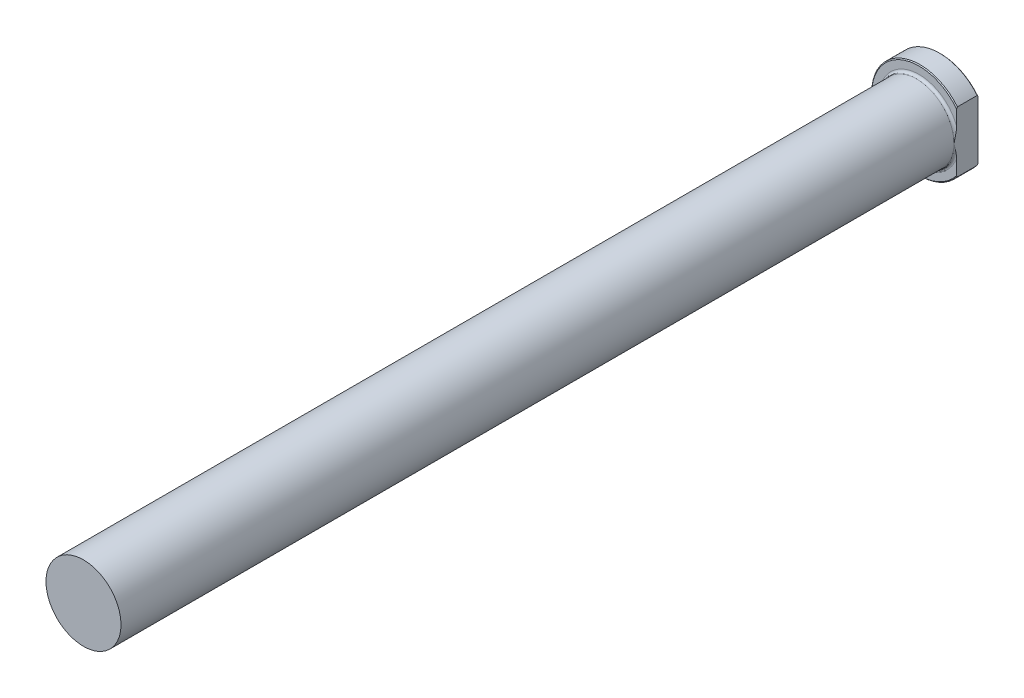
ISO-10303-21;
HEADER;
FILE_DESCRIPTION(('STEP AP214'),'2;1');
FILE_NAME('part.step','',(''),(''),'','','');
FILE_SCHEMA(('AUTOMOTIVE_DESIGN { 1 0 10303 214 1 1 1 1 }'));
ENDSEC;
DATA;
#1=APPLICATION_CONTEXT('core data for automotive mechanical design processes');
#2=APPLICATION_PROTOCOL_DEFINITION('international standard','automotive_design',2000,#1);
#3=PRODUCT_CONTEXT('',#1,'mechanical');
#4=PRODUCT('Part','Part','',(#3));
#5=PRODUCT_RELATED_PRODUCT_CATEGORY('part','',(#4));
#6=PRODUCT_DEFINITION_FORMATION('','',#4);
#7=PRODUCT_DEFINITION_CONTEXT('part definition',#1,'design');
#8=PRODUCT_DEFINITION('design','',#6,#7);
#9=PRODUCT_DEFINITION_SHAPE('','',#8);
#10=(LENGTH_UNIT() NAMED_UNIT(*) SI_UNIT(.MILLI.,.METRE.));
#11=(NAMED_UNIT(*) PLANE_ANGLE_UNIT() SI_UNIT($,.RADIAN.));
#12=(NAMED_UNIT(*) SI_UNIT($,.STERADIAN.) SOLID_ANGLE_UNIT());
#13=UNCERTAINTY_MEASURE_WITH_UNIT(LENGTH_MEASURE(1.E-05),#10,'distance_accuracy_value','');
#14=(GEOMETRIC_REPRESENTATION_CONTEXT(3) GLOBAL_UNCERTAINTY_ASSIGNED_CONTEXT((#13)) GLOBAL_UNIT_ASSIGNED_CONTEXT((#10,
#11,#12)) REPRESENTATION_CONTEXT('',''));
#15=CARTESIAN_POINT('',(0.,0.,0.));
#16=DIRECTION('',(0.,0.,1.));
#17=DIRECTION('',(1.,0.,0.));
#18=AXIS2_PLACEMENT_3D('',#15,#16,#17);
#19=CARTESIAN_POINT('',(0.,11.1125,254.));
#20=DIRECTION('',(0.,0.,1.));
#21=DIRECTION('',(1.,0.,0.));
#22=AXIS2_PLACEMENT_3D('',#19,#20,#21);
#23=PLANE('',#22);
#24=CARTESIAN_POINT('',(0.,0.,254.));
#25=DIRECTION('',(0.,0.,-1.));
#26=DIRECTION('',(-1.,0.,0.));
#27=AXIS2_PLACEMENT_3D('',#24,#25,#26);
#28=CIRCLE('',#27,11.1125);
#29=CARTESIAN_POINT('',(-11.1125,0.,254.));
#30=VERTEX_POINT('',#29);
#31=EDGE_CURVE('E96',#30,#30,#28,.T.);
#32=ORIENTED_EDGE('',*,*,#31,.F.);
#33=EDGE_LOOP('',(#32));
#34=FACE_BOUND('',#33,.T.);
#35=ADVANCED_FACE('F32',(#34),#23,.T.);
#36=CARTESIAN_POINT('',(0.,0.,-25.4347445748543));
#37=DIRECTION('',(0.,0.,-1.));
#38=DIRECTION('',(-1.,0.,0.));
#39=AXIS2_PLACEMENT_3D('',#36,#37,#38);
#40=CYLINDRICAL_SURFACE('',#39,11.1125);
#41=ORIENTED_EDGE('',*,*,#31,.T.);
#42=EDGE_LOOP('',(#41));
#43=FACE_BOUND('',#42,.T.);
#44=CARTESIAN_POINT('',(0.,0.,7.112));
#45=DIRECTION('',(0.,0.,-1.));
#46=DIRECTION('',(-1.,0.,0.));
#47=AXIS2_PLACEMENT_3D('',#44,#45,#46);
#48=CIRCLE('',#47,11.1125);
#49=CARTESIAN_POINT('',(11.1125,0.,7.112));
#50=VERTEX_POINT('',#49);
#51=EDGE_CURVE('E101',#50,#50,#48,.T.);
#52=ORIENTED_EDGE('',*,*,#51,.F.);
#53=EDGE_LOOP('',(#52));
#54=FACE_BOUND('',#53,.T.);
#55=ADVANCED_FACE('F158',(#43,#54),#40,.T.);
#56=CARTESIAN_POINT('',(0.,0.,7.112));
#57=DIRECTION('',(0.,0.,-1.));
#58=DIRECTION('',(-1.,0.,0.));
#59=AXIS2_PLACEMENT_3D('',#56,#57,#58);
#60=TOROIDAL_SURFACE('',#59,11.8745,0.762);
#61=CARTESIAN_POINT('',(11.1125,0.,7.112));
#62=CARTESIAN_POINT('',(11.1125,-1.67611020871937E-08,7.11200106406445));
#63=CARTESIAN_POINT('',(11.1125,-4.27713042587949E-07,7.11200212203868));
#64=CARTESIAN_POINT('',(11.1125,-1.56369238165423E-06,7.11200409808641));
#65=CARTESIAN_POINT('',(11.1125,-2.31371138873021E-06,7.11200499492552));
#66=CARTESIAN_POINT('',(11.1125,-4.10315210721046E-06,7.11200684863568));
#67=CARTESIAN_POINT('',(11.1125,-5.17038967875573E-06,7.11200778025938));
#68=CARTESIAN_POINT('',(11.1125,-7.38559077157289E-06,7.11200945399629));
#69=CARTESIAN_POINT('',(11.1125,-8.53014703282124E-06,7.11201020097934));
#70=CARTESIAN_POINT('',(11.1125,-1.29295019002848E-05,7.11201295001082));
#71=CARTESIAN_POINT('',(11.1125,-1.62851494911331E-05,7.11201479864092));
#72=CARTESIAN_POINT('',(11.1125,-2.29428224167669E-05,7.11201785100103));
#73=CARTESIAN_POINT('',(11.1125,-2.62272900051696E-05,7.11201909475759));
#74=CARTESIAN_POINT('',(11.1125,-3.99938929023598E-05,7.11202425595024));
#75=CARTESIAN_POINT('',(11.1125,-5.05186742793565E-05,7.11202807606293));
#76=CARTESIAN_POINT('',(11.1125,-7.04373179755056E-05,7.11203374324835));
#77=CARTESIAN_POINT('',(11.1125,-7.97721508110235E-05,7.11203579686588));
#78=CARTESIAN_POINT('',(11.1125,-0.000147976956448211,7.11205053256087));
#79=CARTESIAN_POINT('',(11.1125,-0.000207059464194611,7.11206183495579));
#80=CARTESIAN_POINT('',(11.1125,-0.000433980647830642,7.11211014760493));
#81=CARTESIAN_POINT('',(11.1125,-0.00059992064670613,7.11215590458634));
#82=CARTESIAN_POINT('',(11.1125,-0.00122634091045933,7.112325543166));
#83=CARTESIAN_POINT('',(11.1125,-0.00168778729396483,7.1124442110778));
#84=CARTESIAN_POINT('',(11.1125,-0.00344560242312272,7.11289909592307));
#85=CARTESIAN_POINT('',(11.1125,-0.00474111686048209,7.11324022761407));
#86=CARTESIAN_POINT('',(11.1125,-0.0108222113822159,7.11483888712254));
#87=CARTESIAN_POINT('',(11.1125,-0.0156088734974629,7.11608969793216));
#88=CARTESIAN_POINT('',(11.1125,-0.0903897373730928,7.13563489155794));
#89=CARTESIAN_POINT('',(11.1125,-0.160375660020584,7.1539826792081));
#90=CARTESIAN_POINT('',(11.1125,-0.297803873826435,7.18989721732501));
#91=CARTESIAN_POINT('',(11.1125,-0.3652452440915,7.20746791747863));
#92=CARTESIAN_POINT('',(11.1125,-0.50791898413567,7.24449206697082));
#93=CARTESIAN_POINT('',(11.1125,-0.583155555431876,7.26392970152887));
#94=CARTESIAN_POINT('',(11.1125,-0.734445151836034,7.30273302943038));
#95=CARTESIAN_POINT('',(11.1125,-0.810498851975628,7.3220960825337));
#96=CARTESIAN_POINT('',(11.1125,-0.989563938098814,7.36723281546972));
#97=CARTESIAN_POINT('',(11.1125,-1.09261341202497,7.39285636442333));
#98=CARTESIAN_POINT('',(11.1125,-1.29644189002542,7.44258460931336));
#99=CARTESIAN_POINT('',(11.1125,-1.39721560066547,7.46671104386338));
#100=CARTESIAN_POINT('',(11.1125,-1.73446900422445,7.54550507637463));
#101=CARTESIAN_POINT('',(11.1125,-1.97153771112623,7.59769827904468));
#102=CARTESIAN_POINT('',(11.1125,-2.44993274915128,7.69299233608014));
#103=CARTESIAN_POINT('',(11.1125,-2.69127811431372,7.73600141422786));
#104=CARTESIAN_POINT('',(11.1125,-3.06699799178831,7.79141180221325));
#105=CARTESIAN_POINT('',(11.1125,-3.20062030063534,7.80887604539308));
#106=CARTESIAN_POINT('',(11.1125,-3.46845562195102,7.83835554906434));
#107=CARTESIAN_POINT('',(11.1125,-3.60266850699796,7.85037193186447));
#108=CARTESIAN_POINT('',(11.1125,-3.87097309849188,7.8675958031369));
#109=CARTESIAN_POINT('',(11.1125,-4.00506287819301,7.87283212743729));
#110=CARTESIAN_POINT('',(11.1125,-4.27327734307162,7.87482540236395));
#111=CARTESIAN_POINT('',(11.1125,-4.40740193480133,7.87158841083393));
#112=CARTESIAN_POINT('',(11.1125,-4.61449108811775,7.85800680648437));
#113=CARTESIAN_POINT('',(11.1125,-4.6877097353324,7.85153417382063));
#114=CARTESIAN_POINT('',(11.1125,-4.83376141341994,7.83463637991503));
#115=CARTESIAN_POINT('',(11.1125,-4.90659410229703,7.82420816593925));
#116=CARTESIAN_POINT('',(11.1125,-5.05050874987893,7.7987618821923));
#117=CARTESIAN_POINT('',(11.1125,-5.12160117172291,7.78380480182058));
#118=CARTESIAN_POINT('',(11.1125,-5.26228423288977,7.74819711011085));
#119=CARTESIAN_POINT('',(11.1125,-5.33187647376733,7.727552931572));
#120=CARTESIAN_POINT('',(11.1125,-5.46945846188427,7.67868213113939));
#121=CARTESIAN_POINT('',(11.1125,-5.53741805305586,7.65036554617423));
#122=CARTESIAN_POINT('',(11.1125,-5.63548783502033,7.60047171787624));
#123=CARTESIAN_POINT('',(11.1125,-5.6674953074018,7.58263080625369));
#124=CARTESIAN_POINT('',(11.1125,-5.72968299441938,7.54403192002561));
#125=CARTESIAN_POINT('',(11.1125,-5.75986551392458,7.52327773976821));
#126=CARTESIAN_POINT('',(11.1125,-5.81159971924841,7.48298973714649));
#127=CARTESIAN_POINT('',(11.1125,-5.83364406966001,7.46409379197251));
#128=CARTESIAN_POINT('',(11.1125,-5.87543896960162,7.42384449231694));
#129=CARTESIAN_POINT('',(11.1125,-5.89518772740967,7.40248924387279));
#130=CARTESIAN_POINT('',(11.1125,-5.93165740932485,7.3568536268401));
#131=CARTESIAN_POINT('',(11.1125,-5.94833864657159,7.33254088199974));
#132=CARTESIAN_POINT('',(11.1125,-5.97700292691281,7.28128516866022));
#133=CARTESIAN_POINT('',(11.1125,-5.98899940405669,7.25435000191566));
#134=CARTESIAN_POINT('',(11.1125,-6.00431459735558,7.20647064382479));
#135=CARTESIAN_POINT('',(11.1125,-6.0091319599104,7.1860063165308));
#136=CARTESIAN_POINT('',(11.1125,-6.01523377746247,7.14455694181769));
#137=CARTESIAN_POINT('',(11.1125,-6.01652073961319,7.12357227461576));
#138=CARTESIAN_POINT('',(11.1125,-6.01544006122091,7.08168897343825));
#139=CARTESIAN_POINT('',(11.1125,-6.01307056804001,7.06079038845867));
#140=CARTESIAN_POINT('',(11.1125,-6.00489715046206,7.01967752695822));
#141=CARTESIAN_POINT('',(11.1125,-5.99909062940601,6.99946378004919));
#142=CARTESIAN_POINT('',(11.1125,-5.98247009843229,6.95468538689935));
#143=CARTESIAN_POINT('',(11.1125,-5.97071281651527,6.93047316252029));
#144=CARTESIAN_POINT('',(11.1125,-5.94345673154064,6.8842647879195));
#145=CARTESIAN_POINT('',(11.1125,-5.92795063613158,6.86227307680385));
#146=CARTESIAN_POINT('',(11.1125,-5.88498216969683,6.80914644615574));
#147=CARTESIAN_POINT('',(11.1125,-5.85561197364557,6.77956849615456));
#148=CARTESIAN_POINT('',(11.1125,-5.79282477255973,6.72511568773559));
#149=CARTESIAN_POINT('',(11.1125,-5.75939772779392,6.70025290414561));
#150=CARTESIAN_POINT('',(11.1125,-5.69209466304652,6.65587224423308));
#151=CARTESIAN_POINT('',(11.1125,-5.65836979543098,6.63612115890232));
#152=CARTESIAN_POINT('',(11.1125,-5.58935575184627,6.59954443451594));
#153=CARTESIAN_POINT('',(11.1125,-5.55406519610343,6.58272144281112));
#154=CARTESIAN_POINT('',(11.1125,-5.44648929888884,6.53592920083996));
#155=CARTESIAN_POINT('',(11.1125,-5.37258613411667,6.50968939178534));
#156=CARTESIAN_POINT('',(11.1125,-5.21497937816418,6.46235711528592));
#157=CARTESIAN_POINT('',(11.1125,-5.13104738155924,6.44206732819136));
#158=CARTESIAN_POINT('',(11.1125,-4.96174447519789,6.40841568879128));
#159=CARTESIAN_POINT('',(11.1125,-4.87637198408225,6.39506204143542));
#160=CARTESIAN_POINT('',(11.1125,-4.70479103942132,6.37390089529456));
#161=CARTESIAN_POINT('',(11.1125,-4.61858122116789,6.36610493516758));
#162=CARTESIAN_POINT('',(11.1125,-4.44593800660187,6.35511276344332));
#163=CARTESIAN_POINT('',(11.1125,-4.35950478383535,6.35191367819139));
#164=CARTESIAN_POINT('',(11.1125,-4.18313627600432,6.34931657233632));
#165=CARTESIAN_POINT('',(11.1125,-4.09319902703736,6.35007550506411));
#166=CARTESIAN_POINT('',(11.1125,-3.91341855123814,6.35512380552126));
#167=CARTESIAN_POINT('',(11.1125,-3.82357534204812,6.35941374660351));
#168=CARTESIAN_POINT('',(11.1125,-3.55421624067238,6.37680685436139));
#169=CARTESIAN_POINT('',(11.1125,-3.37499035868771,6.39443360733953));
#170=CARTESIAN_POINT('',(11.1125,-3.01724255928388,6.43872831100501));
#171=CARTESIAN_POINT('',(11.1125,-2.83872376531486,6.46542009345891));
#172=CARTESIAN_POINT('',(11.1125,-2.48281647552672,6.52563853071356));
#173=CARTESIAN_POINT('',(11.1125,-2.30542826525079,6.55916684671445));
#174=CARTESIAN_POINT('',(11.1125,-1.77419791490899,6.66743099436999));
#175=CARTESIAN_POINT('',(11.1125,-1.42193024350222,6.74975312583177));
#176=CARTESIAN_POINT('',(11.1125,-0.719954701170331,6.92356271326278));
#177=CARTESIAN_POINT('',(11.1125,-0.370245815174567,7.01504629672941));
#178=CARTESIAN_POINT('',(11.1125,-0.0205007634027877,7.10663167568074));
#179=CARTESIAN_POINT('',(11.1125,-0.0204481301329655,7.10664545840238));
#180=CARTESIAN_POINT('',(11.1125,-0.0162997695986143,7.10773169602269));
#181=CARTESIAN_POINT('',(11.1125,-0.0122031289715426,7.1087993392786));
#182=CARTESIAN_POINT('',(11.1125,-0.00628537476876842,7.11035639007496));
#183=CARTESIAN_POINT('',(11.1125,-0.00446277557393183,7.1108379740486));
#184=CARTESIAN_POINT('',(11.1125,-0.00204051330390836,7.11146349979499));
#185=CARTESIAN_POINT('',(11.1125,-0.00144261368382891,7.11161673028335));
#186=CARTESIAN_POINT('',(11.1125,-0.000656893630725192,7.11182849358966));
#187=CARTESIAN_POINT('',(11.1125,-0.000467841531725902,7.11188024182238));
#188=CARTESIAN_POINT('',(11.1125,-0.00021430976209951,7.11193400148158));
#189=CARTESIAN_POINT('',(11.1125,-0.000151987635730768,7.11194599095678));
#190=CARTESIAN_POINT('',(11.1125,-8.04801663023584E-05,7.1119621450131));
#191=CARTESIAN_POINT('',(11.1125,-7.09650876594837E-05,7.11196434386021));
#192=CARTESIAN_POINT('',(11.1125,-5.06772342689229E-05,7.11197043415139));
#193=CARTESIAN_POINT('',(11.1125,-3.99730840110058E-05,7.11197455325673));
#194=CARTESIAN_POINT('',(11.1125,-2.60206358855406E-05,7.11198010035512));
#195=CARTESIAN_POINT('',(11.1125,-2.27227327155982E-05,7.11198142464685));
#196=CARTESIAN_POINT('',(11.1125,-1.60514765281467E-05,7.11198465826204));
#197=CARTESIAN_POINT('',(11.1125,-1.26973598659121E-05,7.11198660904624));
#198=CARTESIAN_POINT('',(11.1125,-8.31552030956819E-06,7.11198949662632));
#199=CARTESIAN_POINT('',(11.1125,-7.17988707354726E-06,7.11199027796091));
#200=CARTESIAN_POINT('',(11.1125,-4.98873222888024E-06,7.11199202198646));
#201=CARTESIAN_POINT('',(11.1125,-3.9368368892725E-06,7.11199298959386));
#202=CARTESIAN_POINT('',(11.1125,-2.18345078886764E-06,7.11199490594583));
#203=CARTESIAN_POINT('',(11.1125,-1.45279949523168E-06,7.1119958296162));
#204=CARTESIAN_POINT('',(11.1125,-3.65698454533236E-07,7.11199785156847));
#205=CARTESIAN_POINT('',(11.1125,1.68723996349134E-08,7.11199892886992));
#206=CARTESIAN_POINT('',(11.1125,0.,7.112));
#207=B_SPLINE_CURVE_WITH_KNOTS('',3,(#61,#62,#63,#64,#65,#66,#67,#68,#69,#70,#71,#72,#73,#74,
#75,#76,#77,#78,#79,#80,#81,#82,#83,#84,#85,#86,#87,#88,#89,#90,#91,#92,#93,#94,#95,#96,#97,#98,
#99,#100,#101,#102,#103,#104,#105,#106,#107,#108,#109,#110,#111,#112,#113,#114,#115,#116,#117,
#118,#119,#120,#121,#122,#123,#124,#125,#126,#127,#128,#129,#130,#131,#132,#133,#134,#135,#136,
#137,#138,#139,#140,#141,#142,#143,#144,#145,#146,#147,#148,#149,#150,#151,#152,#153,#154,#155,
#156,#157,#158,#159,#160,#161,#162,#163,#164,#165,#166,#167,#168,#169,#170,#171,#172,#173,#174,
#175,#176,#177,#178,#179,#180,#181,#182,#183,#184,#185,#186,#187,#188,#189,#190,#191,#192,#193,
#194,#195,#196,#197,#198,#199,#200,#201,#202,#203,#204,#205,#206),.UNSPECIFIED.,.T.,.F.,(4,2,2,
2,2,2,2,2,2,2,2,2,2,2,2,2,2,2,2,2,2,2,2,2,2,2,2,2,2,2,2,2,2,2,2,2,2,2,2,2,2,2,2,2,2,2,2,2,2,2,2,
2,2,2,2,2,2,2,2,2,2,2,2,2,2,2,2,2,2,2,2,2,4),(0.,3.21748936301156E-06,6.72527033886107E-06,
1.09505962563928E-05,1.50484345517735E-05,2.650034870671E-05,3.70273558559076E-05,
7.05609784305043E-05,9.92021914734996E-05,0.000279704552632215,0.000795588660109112,
0.00222546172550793,0.00624395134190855,0.0210868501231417,0.23813285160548,0.447212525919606,
0.680332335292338,0.915771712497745,1.23432999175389,1.54519220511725,2.27332049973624,
3.00841570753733,3.41260707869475,3.81671514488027,4.21909881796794,4.62119489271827,
4.84162349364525,5.0622225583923,5.27997385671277,5.49747985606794,5.71765571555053,
5.8274700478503,5.93714265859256,6.02409526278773,6.11111528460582,6.19919218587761,
6.28701462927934,6.34981252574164,6.41256581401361,6.4753509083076,6.53818349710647,
6.61848147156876,6.69893691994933,6.82328358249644,6.94794450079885,7.06501811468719,
7.18219703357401,7.41685552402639,7.67555303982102,7.9345558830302,8.19409490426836,
8.45347160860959,8.72321009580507,8.99299239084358,9.5329146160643,10.0742674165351,
10.6157519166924,11.7006579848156,12.7851073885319,12.7852706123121,12.7979720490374,
12.8036266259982,12.8054789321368,12.8060663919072,12.8062568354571,12.8062860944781,
12.8063204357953,12.806331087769,12.8063426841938,12.806346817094,12.8063510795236,
12.8063546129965,12.8063578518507),.UNSPECIFIED.);
#208=CARTESIAN_POINT('',(11.1125,-4.18522329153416,6.35));
#209=VERTEX_POINT('',#208);
#210=EDGE_CURVE('E142',#209,#50,#207,.T.);
#211=ORIENTED_EDGE('',*,*,#210,.T.);
#212=ORIENTED_EDGE('',*,*,#51,.T.);
#213=CARTESIAN_POINT('',(11.1125,0.,7.112));
#214=CARTESIAN_POINT('',(11.1125,1.6761101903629E-08,7.11199893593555));
#215=CARTESIAN_POINT('',(11.1125,4.27713042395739E-07,7.11199787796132));
#216=CARTESIAN_POINT('',(11.1125,1.5636923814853E-06,7.11199590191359));
#217=CARTESIAN_POINT('',(11.1125,2.31371138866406E-06,7.11199500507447));
#218=CARTESIAN_POINT('',(11.1125,4.10315210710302E-06,7.11199315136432));
#219=CARTESIAN_POINT('',(11.1125,5.17038967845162E-06,7.11199221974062));
#220=CARTESIAN_POINT('',(11.1125,7.38559077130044E-06,7.11199054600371));
#221=CARTESIAN_POINT('',(11.1125,8.53014703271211E-06,7.11198979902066));
#222=CARTESIAN_POINT('',(11.1125,1.29295019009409E-05,7.11198704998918));
#223=CARTESIAN_POINT('',(11.1125,1.6285149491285E-05,7.11198520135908));
#224=CARTESIAN_POINT('',(11.1125,2.29428224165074E-05,7.11198214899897));
#225=CARTESIAN_POINT('',(11.1125,2.622729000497E-05,7.1119809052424));
#226=CARTESIAN_POINT('',(11.1125,3.99938929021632E-05,7.11197574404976));
#227=CARTESIAN_POINT('',(11.1125,5.05186742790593E-05,7.11197192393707));
#228=CARTESIAN_POINT('',(11.1125,7.04373179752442E-05,7.11196625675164));
#229=CARTESIAN_POINT('',(11.1125,7.97721508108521E-05,7.11196420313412));
#230=CARTESIAN_POINT('',(11.1125,0.000147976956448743,7.11194946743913));
#231=CARTESIAN_POINT('',(11.1125,0.000207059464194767,7.1119381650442));
#232=CARTESIAN_POINT('',(11.1125,0.000433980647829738,7.11188985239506));
#233=CARTESIAN_POINT('',(11.1125,0.000599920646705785,7.11184409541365));
#234=CARTESIAN_POINT('',(11.1125,0.00122634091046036,7.111674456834));
#235=CARTESIAN_POINT('',(11.1125,0.00168778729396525,7.1115557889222));
#236=CARTESIAN_POINT('',(11.1125,0.00344560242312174,7.11110090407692));
#237=CARTESIAN_POINT('',(11.1125,0.00474111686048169,7.11075977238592));
#238=CARTESIAN_POINT('',(11.1125,0.0108222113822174,7.10916111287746));
#239=CARTESIAN_POINT('',(11.1125,0.0156088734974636,7.10791030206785));
#240=CARTESIAN_POINT('',(11.1125,0.0903897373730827,7.08836510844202));
#241=CARTESIAN_POINT('',(11.1125,0.160375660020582,7.07001732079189));
#242=CARTESIAN_POINT('',(11.1125,0.297803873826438,7.034102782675));
#243=CARTESIAN_POINT('',(11.1125,0.365245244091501,7.01653208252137));
#244=CARTESIAN_POINT('',(11.1125,0.507918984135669,6.97950793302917));
#245=CARTESIAN_POINT('',(11.1125,0.583155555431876,6.96007029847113));
#246=CARTESIAN_POINT('',(11.1125,0.734445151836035,6.92126697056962));
#247=CARTESIAN_POINT('',(11.1125,0.810498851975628,6.9019039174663));
#248=CARTESIAN_POINT('',(11.1125,0.989563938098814,6.85676718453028));
#249=CARTESIAN_POINT('',(11.1125,1.09261341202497,6.83114363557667));
#250=CARTESIAN_POINT('',(11.1125,1.29644189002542,6.78141539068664));
#251=CARTESIAN_POINT('',(11.1125,1.39721560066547,6.75728895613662));
#252=CARTESIAN_POINT('',(11.1125,1.73446900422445,6.67849492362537));
#253=CARTESIAN_POINT('',(11.1125,1.97153771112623,6.62630172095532));
#254=CARTESIAN_POINT('',(11.1125,2.44993274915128,6.53100766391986));
#255=CARTESIAN_POINT('',(11.1125,2.69127811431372,6.48799858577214));
#256=CARTESIAN_POINT('',(11.1125,3.06699799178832,6.43258819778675));
#257=CARTESIAN_POINT('',(11.1125,3.20062030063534,6.41512395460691));
#258=CARTESIAN_POINT('',(11.1125,3.46845562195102,6.38564445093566));
#259=CARTESIAN_POINT('',(11.1125,3.60266850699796,6.37362806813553));
#260=CARTESIAN_POINT('',(11.1125,3.87097309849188,6.3564041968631));
#261=CARTESIAN_POINT('',(11.1125,4.00506287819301,6.35116787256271));
#262=CARTESIAN_POINT('',(11.1125,4.27327734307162,6.34917459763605));
#263=CARTESIAN_POINT('',(11.1125,4.40740193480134,6.35241158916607));
#264=CARTESIAN_POINT('',(11.1125,4.61449108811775,6.36599319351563));
#265=CARTESIAN_POINT('',(11.1125,4.6877097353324,6.37246582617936));
#266=CARTESIAN_POINT('',(11.1125,4.83376141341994,6.38936362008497));
#267=CARTESIAN_POINT('',(11.1125,4.90659410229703,6.39979183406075));
#268=CARTESIAN_POINT('',(11.1125,5.05050874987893,6.4252381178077));
#269=CARTESIAN_POINT('',(11.1125,5.12160117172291,6.44019519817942));
#270=CARTESIAN_POINT('',(11.1125,5.26228423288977,6.47580288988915));
#271=CARTESIAN_POINT('',(11.1125,5.33187647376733,6.496447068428));
#272=CARTESIAN_POINT('',(11.1125,5.46945846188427,6.54531786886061));
#273=CARTESIAN_POINT('',(11.1125,5.53741805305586,6.57363445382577));
#274=CARTESIAN_POINT('',(11.1125,5.63548783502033,6.62352828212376));
#275=CARTESIAN_POINT('',(11.1125,5.6674953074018,6.64136919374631));
#276=CARTESIAN_POINT('',(11.1125,5.72968299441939,6.67996807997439));
#277=CARTESIAN_POINT('',(11.1125,5.75986551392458,6.70072226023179));
#278=CARTESIAN_POINT('',(11.1125,5.81159971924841,6.74101026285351));
#279=CARTESIAN_POINT('',(11.1125,5.83364406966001,6.75990620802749));
#280=CARTESIAN_POINT('',(11.1125,5.87543896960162,6.80015550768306));
#281=CARTESIAN_POINT('',(11.1125,5.89518772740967,6.82151075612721));
#282=CARTESIAN_POINT('',(11.1125,5.93165740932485,6.8671463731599));
#283=CARTESIAN_POINT('',(11.1125,5.94833864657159,6.89145911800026));
#284=CARTESIAN_POINT('',(11.1125,5.97700292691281,6.94271483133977));
#285=CARTESIAN_POINT('',(11.1125,5.98899940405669,6.96964999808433));
#286=CARTESIAN_POINT('',(11.1125,6.00431459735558,7.01752935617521));
#287=CARTESIAN_POINT('',(11.1125,6.0091319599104,7.0379936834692));
#288=CARTESIAN_POINT('',(11.1125,6.01523377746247,7.07944305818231));
#289=CARTESIAN_POINT('',(11.1125,6.01652073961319,7.10042772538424));
#290=CARTESIAN_POINT('',(11.1125,6.01544006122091,7.14231102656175));
#291=CARTESIAN_POINT('',(11.1125,6.01307056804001,7.16320961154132));
#292=CARTESIAN_POINT('',(11.1125,6.00489715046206,7.20432247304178));
#293=CARTESIAN_POINT('',(11.1125,5.99909062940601,7.2245362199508));
#294=CARTESIAN_POINT('',(11.1125,5.98247009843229,7.26931461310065));
#295=CARTESIAN_POINT('',(11.1125,5.97071281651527,7.29352683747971));
#296=CARTESIAN_POINT('',(11.1125,5.94345673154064,7.33973521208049));
#297=CARTESIAN_POINT('',(11.1125,5.92795063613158,7.36172692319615));
#298=CARTESIAN_POINT('',(11.1125,5.88498216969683,7.41485355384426));
#299=CARTESIAN_POINT('',(11.1125,5.85561197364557,7.44443150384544));
#300=CARTESIAN_POINT('',(11.1125,5.79282477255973,7.49888431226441));
#301=CARTESIAN_POINT('',(11.1125,5.75939772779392,7.52374709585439));
#302=CARTESIAN_POINT('',(11.1125,5.69209466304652,7.56812775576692));
#303=CARTESIAN_POINT('',(11.1125,5.65836979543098,7.58787884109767));
#304=CARTESIAN_POINT('',(11.1125,5.58935575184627,7.62445556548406));
#305=CARTESIAN_POINT('',(11.1125,5.55406519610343,7.64127855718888));
#306=CARTESIAN_POINT('',(11.1125,5.44648929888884,7.68807079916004));
#307=CARTESIAN_POINT('',(11.1125,5.37258613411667,7.71431060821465));
#308=CARTESIAN_POINT('',(11.1125,5.21497937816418,7.76164288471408));
#309=CARTESIAN_POINT('',(11.1125,5.13104738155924,7.78193267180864));
#310=CARTESIAN_POINT('',(11.1125,4.96174447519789,7.81558431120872));
#311=CARTESIAN_POINT('',(11.1125,4.87637198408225,7.82893795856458));
#312=CARTESIAN_POINT('',(11.1125,4.70479103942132,7.85009910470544));
#313=CARTESIAN_POINT('',(11.1125,4.61858122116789,7.85789506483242));
#314=CARTESIAN_POINT('',(11.1125,4.44593800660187,7.86888723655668));
#315=CARTESIAN_POINT('',(11.1125,4.35950478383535,7.8720863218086));
#316=CARTESIAN_POINT('',(11.1125,4.18313627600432,7.87468342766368));
#317=CARTESIAN_POINT('',(11.1125,4.09319902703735,7.87392449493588));
#318=CARTESIAN_POINT('',(11.1125,3.91341855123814,7.86887619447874));
#319=CARTESIAN_POINT('',(11.1125,3.82357534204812,7.86458625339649));
#320=CARTESIAN_POINT('',(11.1125,3.55421624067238,7.84719314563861));
#321=CARTESIAN_POINT('',(11.1125,3.37499035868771,7.82956639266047));
#322=CARTESIAN_POINT('',(11.1125,3.01724255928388,7.78527168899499));
#323=CARTESIAN_POINT('',(11.1125,2.83872376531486,7.75857990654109));
#324=CARTESIAN_POINT('',(11.1125,2.48281647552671,7.69836146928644));
#325=CARTESIAN_POINT('',(11.1125,2.30542826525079,7.66483315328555));
#326=CARTESIAN_POINT('',(11.1125,1.77419791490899,7.55656900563));
#327=CARTESIAN_POINT('',(11.1125,1.42193024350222,7.47424687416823));
#328=CARTESIAN_POINT('',(11.1125,0.719954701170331,7.30043728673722));
#329=CARTESIAN_POINT('',(11.1125,0.370245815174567,7.20895370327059));
#330=CARTESIAN_POINT('',(11.1125,0.0205007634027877,7.11736832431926));
#331=CARTESIAN_POINT('',(11.1125,0.0204481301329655,7.11735454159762));
#332=CARTESIAN_POINT('',(11.1125,0.0162997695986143,7.11626830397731));
#333=CARTESIAN_POINT('',(11.1125,0.0122031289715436,7.1152006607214));
#334=CARTESIAN_POINT('',(11.1125,0.00628537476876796,7.11364360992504));
#335=CARTESIAN_POINT('',(11.1125,0.0044627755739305,7.11316202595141));
#336=CARTESIAN_POINT('',(11.1125,0.0020405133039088,7.112536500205));
#337=CARTESIAN_POINT('',(11.1125,0.00144261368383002,7.11238326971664));
#338=CARTESIAN_POINT('',(11.1125,0.000656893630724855,7.11217150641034));
#339=CARTESIAN_POINT('',(11.1125,0.000467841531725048,7.11211975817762));
#340=CARTESIAN_POINT('',(11.1125,0.000214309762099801,7.11206599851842));
#341=CARTESIAN_POINT('',(11.1125,0.000151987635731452,7.11205400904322));
#342=CARTESIAN_POINT('',(11.1125,8.0480166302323E-05,7.1120378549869));
#343=CARTESIAN_POINT('',(11.1125,7.09650876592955E-05,7.11203565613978));
#344=CARTESIAN_POINT('',(11.1125,5.06772342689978E-05,7.11202956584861));
#345=CARTESIAN_POINT('',(11.1125,3.99730840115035E-05,7.11202544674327));
#346=CARTESIAN_POINT('',(11.1125,2.60206358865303E-05,7.11201989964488));
#347=CARTESIAN_POINT('',(11.1125,2.27227327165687E-05,7.11201857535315));
#348=CARTESIAN_POINT('',(11.1125,1.60514765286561E-05,7.11201534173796));
#349=CARTESIAN_POINT('',(11.1125,1.2697359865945E-05,7.11201339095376));
#350=CARTESIAN_POINT('',(11.1125,8.31552030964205E-06,7.11201050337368));
#351=CARTESIAN_POINT('',(11.1125,7.1798870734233E-06,7.11200972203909));
#352=CARTESIAN_POINT('',(11.1125,4.98873222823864E-06,7.11200797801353));
#353=CARTESIAN_POINT('',(11.1125,3.93683688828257E-06,7.11200701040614));
#354=CARTESIAN_POINT('',(11.1125,2.18345078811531E-06,7.11200509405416));
#355=CARTESIAN_POINT('',(11.1125,1.45279949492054E-06,7.1120041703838));
#356=CARTESIAN_POINT('',(11.1125,3.65698454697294E-07,7.11200214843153));
#357=CARTESIAN_POINT('',(11.1125,-1.68723994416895E-08,7.11200107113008));
#358=CARTESIAN_POINT('',(11.1125,0.,7.112));
#359=B_SPLINE_CURVE_WITH_KNOTS('',3,(#213,#214,#215,#216,#217,#218,#219,#220,#221,#222,#223,
#224,#225,#226,#227,#228,#229,#230,#231,#232,#233,#234,#235,#236,#237,#238,#239,#240,#241,#242,
#243,#244,#245,#246,#247,#248,#249,#250,#251,#252,#253,#254,#255,#256,#257,#258,#259,#260,#261,
#262,#263,#264,#265,#266,#267,#268,#269,#270,#271,#272,#273,#274,#275,#276,#277,#278,#279,#280,
#281,#282,#283,#284,#285,#286,#287,#288,#289,#290,#291,#292,#293,#294,#295,#296,#297,#298,#299,
#300,#301,#302,#303,#304,#305,#306,#307,#308,#309,#310,#311,#312,#313,#314,#315,#316,#317,#318,
#319,#320,#321,#322,#323,#324,#325,#326,#327,#328,#329,#330,#331,#332,#333,#334,#335,#336,#337,
#338,#339,#340,#341,#342,#343,#344,#345,#346,#347,#348,#349,#350,#351,#352,#353,#354,#355,#356,
#357,#358),.UNSPECIFIED.,.T.,.F.,(4,2,2,2,2,2,2,2,2,2,2,2,2,2,2,2,2,2,2,2,2,2,2,2,2,2,2,2,2,2,2,
2,2,2,2,2,2,2,2,2,2,2,2,2,2,2,2,2,2,2,2,2,2,2,2,2,2,2,2,2,2,2,2,2,2,2,2,2,2,2,2,2,4),(0.,
3.21748936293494E-06,6.7252703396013E-06,1.09505962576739E-05,1.50484345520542E-05,
2.65003487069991E-05,3.70273558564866E-05,7.05609784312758E-05,9.92021914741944E-05,
0.000279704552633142,0.000795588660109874,0.00222546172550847,0.00624395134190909,
0.0210868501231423,0.238132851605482,0.447212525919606,0.680332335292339,0.915771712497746,
1.23432999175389,1.54519220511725,2.27332049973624,3.00841570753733,3.41260707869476,
3.81671514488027,4.21909881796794,4.62119489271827,4.84162349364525,5.0622225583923,
5.27997385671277,5.49747985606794,5.71765571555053,5.8274700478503,5.93714265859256,
6.02409526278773,6.11111528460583,6.19919218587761,6.28701462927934,6.34981252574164,
6.41256581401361,6.4753509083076,6.53818349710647,6.61848147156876,6.69893691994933,
6.82328358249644,6.94794450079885,7.06501811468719,7.18219703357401,7.41685552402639,
7.67555303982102,7.9345558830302,8.19409490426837,8.45347160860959,8.72321009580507,
8.99299239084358,9.5329146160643,10.0742674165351,10.6157519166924,11.7006579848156,
12.7851073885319,12.7852706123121,12.7979720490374,12.8036266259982,12.8054789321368,
12.8060663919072,12.8062568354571,12.8062860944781,12.8063204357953,12.806331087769,
12.8063426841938,12.806346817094,12.8063510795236,12.8063546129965,12.8063578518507),.UNSPECIFIED.);
#360=CARTESIAN_POINT('',(11.1125,4.18522329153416,6.35));
#361=VERTEX_POINT('',#360);
#362=EDGE_CURVE('E136',#50,#361,#359,.T.);
#363=ORIENTED_EDGE('',*,*,#362,.T.);
#364=CARTESIAN_POINT('',(0.,0.,6.35));
#365=DIRECTION('',(0.,0.,-1.));
#366=DIRECTION('',(-1.,0.,0.));
#367=AXIS2_PLACEMENT_3D('',#364,#365,#366);
#368=CIRCLE('',#367,11.8745);
#369=EDGE_CURVE('E149',#209,#361,#368,.T.);
#370=ORIENTED_EDGE('',*,*,#369,.F.);
#371=EDGE_LOOP('',(#211,#212,#363,#370));
#372=FACE_BOUND('',#371,.T.);
#373=ADVANCED_FACE('F155',(#372),#60,.F.);
#374=CARTESIAN_POINT('',(0.,14.2875,6.35));
#375=DIRECTION('',(0.,0.,1.));
#376=DIRECTION('',(1.,0.,0.));
#377=AXIS2_PLACEMENT_3D('',#374,#375,#376);
#378=PLANE('',#377);
#379=DIRECTION('',(0.,1.,0.));
#380=VECTOR('',#379,1.);
#381=CARTESIAN_POINT('',(11.1125,8.98025612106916,6.34999999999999));
#382=LINE('',#381,#380);
#383=CARTESIAN_POINT('',(11.1125,8.57038307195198,6.35));
#384=VERTEX_POINT('',#383);
#385=EDGE_CURVE('E112',#361,#384,#382,.T.);
#386=ORIENTED_EDGE('',*,*,#385,.T.);
#387=CARTESIAN_POINT('',(0.,0.,6.35));
#388=DIRECTION('',(0.,0.,1.));
#389=DIRECTION('',(1.,0.,0.));
#390=AXIS2_PLACEMENT_3D('',#387,#388,#389);
#391=CIRCLE('',#390,14.0335);
#392=CARTESIAN_POINT('',(11.1125,-8.57038307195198,6.35));
#393=VERTEX_POINT('',#392);
#394=EDGE_CURVE('E11',#384,#393,#391,.T.);
#395=ORIENTED_EDGE('',*,*,#394,.T.);
#396=EDGE_CURVE('E47',#393,#209,#382,.T.);
#397=ORIENTED_EDGE('',*,*,#396,.T.);
#398=ORIENTED_EDGE('',*,*,#369,.T.);
#399=EDGE_LOOP('',(#386,#395,#397,#398));
#400=FACE_BOUND('',#399,.T.);
#401=ADVANCED_FACE('F166',(#400),#378,.T.);
#402=CARTESIAN_POINT('',(0.,0.,-25.4347445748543));
#403=DIRECTION('',(0.,0.,-1.));
#404=DIRECTION('',(-1.,0.,0.));
#405=AXIS2_PLACEMENT_3D('',#402,#403,#404);
#406=CYLINDRICAL_SURFACE('',#405,14.2875);
#407=DIRECTION('',(0.,0.,-1.));
#408=VECTOR('',#407,1.);
#409=CARTESIAN_POINT('',(11.1125,8.98025612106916,254.001));
#410=LINE('',#409,#408);
#411=CARTESIAN_POINT('',(11.1125,8.98025612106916,6.09600000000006));
#412=VERTEX_POINT('',#411);
#413=CARTESIAN_POINT('',(11.1125,8.98025612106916,0.254000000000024));
#414=VERTEX_POINT('',#413);
#415=EDGE_CURVE('E108',#412,#414,#410,.T.);
#416=ORIENTED_EDGE('',*,*,#415,.T.);
#417=CARTESIAN_POINT('',(0.,0.,0.254000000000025));
#418=DIRECTION('',(0.,0.,-1.));
#419=DIRECTION('',(-1.,0.,0.));
#420=AXIS2_PLACEMENT_3D('',#417,#418,#419);
#421=CIRCLE('',#420,14.2875);
#422=CARTESIAN_POINT('',(11.1125,-8.98025612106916,0.254000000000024));
#423=VERTEX_POINT('',#422);
#424=EDGE_CURVE('E40',#414,#423,#421,.F.);
#425=ORIENTED_EDGE('',*,*,#424,.T.);
#426=DIRECTION('',(0.,0.,-1.));
#427=VECTOR('',#426,1.);
#428=CARTESIAN_POINT('',(11.1125,-8.98025612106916,254.001));
#429=LINE('',#428,#427);
#430=CARTESIAN_POINT('',(11.1125,-8.98025612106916,6.09600000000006));
#431=VERTEX_POINT('',#430);
#432=EDGE_CURVE('E86',#431,#423,#429,.T.);
#433=ORIENTED_EDGE('',*,*,#432,.F.);
#434=CARTESIAN_POINT('',(0.,0.,6.09600000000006));
#435=DIRECTION('',(0.,0.,1.));
#436=DIRECTION('',(1.,0.,0.));
#437=AXIS2_PLACEMENT_3D('',#434,#435,#436);
#438=CIRCLE('',#437,14.2875);
#439=EDGE_CURVE('E95',#431,#412,#438,.F.);
#440=ORIENTED_EDGE('',*,*,#439,.T.);
#441=EDGE_LOOP('',(#416,#425,#433,#440));
#442=FACE_BOUND('',#441,.T.);
#443=ADVANCED_FACE('F106',(#442),#406,.T.);
#444=CARTESIAN_POINT('',(0.,0.,0.));
#445=DIRECTION('',(0.,0.,-1.));
#446=DIRECTION('',(-1.,0.,0.));
#447=AXIS2_PLACEMENT_3D('',#444,#445,#446);
#448=PLANE('',#447);
#449=DIRECTION('',(0.,1.,0.));
#450=VECTOR('',#449,1.);
#451=CARTESIAN_POINT('',(11.1125,8.98025612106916,0.));
#452=LINE('',#451,#450);
#453=CARTESIAN_POINT('',(11.1125,-8.57038307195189,0.));
#454=VERTEX_POINT('',#453);
#455=CARTESIAN_POINT('',(11.1125,8.57038307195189,0.));
#456=VERTEX_POINT('',#455);
#457=EDGE_CURVE('E79',#454,#456,#452,.T.);
#458=ORIENTED_EDGE('',*,*,#457,.F.);
#459=CARTESIAN_POINT('',(0.,0.,0.));
#460=DIRECTION('',(0.,0.,-1.));
#461=DIRECTION('',(-1.,0.,0.));
#462=AXIS2_PLACEMENT_3D('',#459,#460,#461);
#463=CIRCLE('',#462,14.0335);
#464=EDGE_CURVE('E91',#454,#456,#463,.T.);
#465=ORIENTED_EDGE('',*,*,#464,.T.);
#466=EDGE_LOOP('',(#458,#465));
#467=FACE_BOUND('',#466,.T.);
#468=ADVANCED_FACE('F94',(#467),#448,.T.);
#469=CARTESIAN_POINT('',(0.,0.,0.));
#470=DIRECTION('',(0.,0.,1.));
#471=DIRECTION('',(1.,0.,0.));
#472=AXIS2_PLACEMENT_3D('',#469,#470,#471);
#473=CONICAL_SURFACE('',#472,14.0335,0.785398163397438);
#474=CARTESIAN_POINT('',(11.1125,19.7578410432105,8.63497897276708));
#475=CARTESIAN_POINT('',(11.1125,19.4667443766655,8.38126866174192));
#476=CARTESIAN_POINT('',(11.1125,19.1749884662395,8.12831262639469));
#477=CARTESIAN_POINT('',(11.1125,18.5899796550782,7.62412874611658));
#478=CARTESIAN_POINT('',(11.1125,18.2967267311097,7.37290092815));
#479=CARTESIAN_POINT('',(11.1125,17.708420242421,6.87228683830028));
#480=CARTESIAN_POINT('',(11.1125,17.4133659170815,6.62290145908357));
#481=CARTESIAN_POINT('',(11.1125,16.8213794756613,6.1263749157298));
#482=CARTESIAN_POINT('',(11.1125,16.5244473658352,5.87923374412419));
#483=CARTESIAN_POINT('',(11.1125,15.6176425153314,5.13103728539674));
#484=CARTESIAN_POINT('',(11.1125,15.0044116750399,4.63402035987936));
#485=CARTESIAN_POINT('',(11.1125,14.0760731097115,3.89937417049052));
#486=CARTESIAN_POINT('',(11.1125,13.7652453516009,3.65633080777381));
#487=CARTESIAN_POINT('',(11.1125,13.1403046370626,3.17450931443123));
#488=CARTESIAN_POINT('',(11.1125,12.8261917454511,2.93573109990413));
#489=CARTESIAN_POINT('',(11.1125,12.193804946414,2.46293577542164));
#490=CARTESIAN_POINT('',(11.1125,11.8755264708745,2.22892476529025));
#491=CARTESIAN_POINT('',(11.1125,11.234592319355,1.7669543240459));
#492=CARTESIAN_POINT('',(11.1125,10.9119365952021,1.53899495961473));
#493=CARTESIAN_POINT('',(11.1125,10.2612911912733,1.09019698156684));
#494=CARTESIAN_POINT('',(11.1125,9.93329721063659,0.869364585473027));
#495=CARTESIAN_POINT('',(11.1125,9.27145545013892,0.43663576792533));
#496=CARTESIAN_POINT('',(11.1125,8.93760779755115,0.224739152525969));
#497=CARTESIAN_POINT('',(11.1125,8.26545804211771,-0.186648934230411));
#498=CARTESIAN_POINT('',(11.1125,7.9272019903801,-0.386215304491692));
#499=CARTESIAN_POINT('',(11.1125,7.24302542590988,-0.771930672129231));
#500=CARTESIAN_POINT('',(11.1125,6.89710399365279,-0.958078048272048));
#501=CARTESIAN_POINT('',(11.1125,6.19719265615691,-1.31335586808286));
#502=CARTESIAN_POINT('',(11.1125,5.84321509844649,-1.48251045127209));
#503=CARTESIAN_POINT('',(11.1125,5.12606957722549,-1.79990096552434));
#504=CARTESIAN_POINT('',(11.1125,4.76290519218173,-1.94814489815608));
#505=CARTESIAN_POINT('',(11.1125,4.01866047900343,-2.22185817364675));
#506=CARTESIAN_POINT('',(11.1125,3.63736079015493,-2.34673806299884));
#507=CARTESIAN_POINT('',(11.1125,2.86531875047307,-2.56350339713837));
#508=CARTESIAN_POINT('',(11.1125,2.47457790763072,-2.65539407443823));
#509=CARTESIAN_POINT('',(11.1125,1.8845156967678,-2.76398903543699));
#510=CARTESIAN_POINT('',(11.1125,1.68781243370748,-2.79525938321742));
#511=CARTESIAN_POINT('',(11.1125,1.29307664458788,-2.84772838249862));
#512=CARTESIAN_POINT('',(11.1125,1.09504431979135,-2.86892852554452));
#513=CARTESIAN_POINT('',(11.1125,0.698140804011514,-2.90084882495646));
#514=CARTESIAN_POINT('',(11.1125,0.499269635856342,-2.91156926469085));
#515=CARTESIAN_POINT('',(11.1125,0.101236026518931,-2.92231957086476));
#516=CARTESIAN_POINT('',(11.1125,-0.0979264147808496,-2.92234943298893));
#517=CARTESIAN_POINT('',(11.1125,-0.496461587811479,-2.91170380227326));
#518=CARTESIAN_POINT('',(11.1125,-0.695833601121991,-2.90100155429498));
#519=CARTESIAN_POINT('',(11.1125,-1.09375577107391,-2.86906468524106));
#520=CARTESIAN_POINT('',(11.1125,-1.29230580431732,-2.84782853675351));
#521=CARTESIAN_POINT('',(11.1125,-1.68805729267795,-2.79522914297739));
#522=CARTESIAN_POINT('',(11.1125,-1.8852587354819,-2.76386580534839));
#523=CARTESIAN_POINT('',(11.1125,-2.27791166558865,-2.69157492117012));
#524=CARTESIAN_POINT('',(11.1125,-2.47336288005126,-2.65064590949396));
#525=CARTESIAN_POINT('',(11.1125,-3.05943014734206,-2.51382595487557));
#526=CARTESIAN_POINT('',(11.1125,-3.44691274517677,-2.4042962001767));
#527=CARTESIAN_POINT('',(11.1125,-4.21183627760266,-2.15510797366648));
#528=CARTESIAN_POINT('',(11.1125,-4.58927688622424,-2.01544852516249));
#529=CARTESIAN_POINT('',(11.1125,-5.40622453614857,-1.682384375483));
#530=CARTESIAN_POINT('',(11.1125,-5.84360804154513,-1.48380913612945));
#531=CARTESIAN_POINT('',(11.1125,-6.70541541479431,-1.06009123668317));
#532=CARTESIAN_POINT('',(11.1125,-7.1298317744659,-0.834933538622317));
#533=CARTESIAN_POINT('',(11.1125,-7.96806254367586,-0.363924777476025));
#534=CARTESIAN_POINT('',(11.1125,-8.38185369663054,-0.118032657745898));
#535=CARTESIAN_POINT('',(11.1125,-9.19960327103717,0.389315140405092));
#536=CARTESIAN_POINT('',(11.1125,-9.60356358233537,0.650767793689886));
#537=CARTESIAN_POINT('',(11.1125,-10.4054989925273,1.18730214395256));
#538=CARTESIAN_POINT('',(11.1125,-10.8034291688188,1.46245066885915));
#539=CARTESIAN_POINT('',(11.1125,-11.5923883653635,2.02246318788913));
#540=CARTESIAN_POINT('',(11.1125,-11.9834171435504,2.30732752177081));
#541=CARTESIAN_POINT('',(11.1125,-12.7592349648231,2.88449774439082));
#542=CARTESIAN_POINT('',(11.1125,-13.1440306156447,3.17679477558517));
#543=CARTESIAN_POINT('',(11.1125,-13.9087435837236,3.76767787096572));
#544=CARTESIAN_POINT('',(11.1125,-14.2886609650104,4.06626385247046));
#545=CARTESIAN_POINT('',(11.1125,-15.1020997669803,4.7146155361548));
#546=CARTESIAN_POINT('',(11.1125,-15.5349429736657,5.06523102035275));
#547=CARTESIAN_POINT('',(11.1125,-16.3960680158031,5.77201152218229));
#548=CARTESIAN_POINT('',(11.1125,-16.8243498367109,6.12817655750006));
#549=CARTESIAN_POINT('',(11.1125,-17.6719912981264,6.8407610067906));
#550=CARTESIAN_POINT('',(11.1125,-18.0913963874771,7.19712644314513));
#551=CARTESIAN_POINT('',(11.1125,-18.9269203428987,7.91348810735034));
#552=CARTESIAN_POINT('',(11.1125,-19.3430399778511,8.27348343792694));
#553=CARTESIAN_POINT('',(11.1125,-19.7578410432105,8.63497897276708));
#554=B_SPLINE_CURVE_WITH_KNOTS('',3,(#474,#475,#476,#477,#478,#479,#480,#481,#482,#483,#484,
#485,#486,#487,#488,#489,#490,#491,#492,#493,#494,#495,#496,#497,#498,#499,#500,#501,#502,#503,
#504,#505,#506,#507,#508,#509,#510,#511,#512,#513,#514,#515,#516,#517,#518,#519,#520,#521,#522,
#523,#524,#525,#526,#527,#528,#529,#530,#531,#532,#533,#534,#535,#536,#537,#538,#539,#540,#541,
#542,#543,#544,#545,#546,#547,#548,#549,#550,#551,#552,#553),.UNSPECIFIED.,.F.,.F.,(4,2,2,2,2,2,
2,2,2,2,2,2,2,2,2,2,2,2,2,2,2,2,2,2,2,2,2,2,2,2,2,2,2,2,2,2,2,2,2,4),(0.,1.15842868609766,
2.31687540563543,3.47585075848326,4.63482225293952,7.00268299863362,8.18635932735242,
9.37001234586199,10.5550952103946,11.7401911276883,12.926294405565,14.1123719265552,
15.2903414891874,16.4684531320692,17.6448667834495,18.8208290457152,20.0233293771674,
21.2256388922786,21.8229414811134,22.4201555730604,23.0173535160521,23.6145517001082,
24.2132424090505,24.8120199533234,25.4108029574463,26.0096777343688,27.2160151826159,
28.4223917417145,29.8622188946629,31.3028645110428,32.7464329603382,34.1897216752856,
35.6409185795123,37.0921662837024,38.5417588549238,39.9913323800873,41.6623696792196,
43.3334123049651,44.9844713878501,46.6351318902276),.UNSPECIFIED.);
#555=EDGE_CURVE('E82',#454,#423,#554,.T.);
#556=ORIENTED_EDGE('',*,*,#555,.T.);
#557=ORIENTED_EDGE('',*,*,#424,.F.);
#558=EDGE_CURVE('E54',#414,#456,#554,.T.);
#559=ORIENTED_EDGE('',*,*,#558,.T.);
#560=ORIENTED_EDGE('',*,*,#464,.F.);
#561=EDGE_LOOP('',(#556,#557,#559,#560));
#562=FACE_BOUND('',#561,.T.);
#563=ADVANCED_FACE('F90',(#562),#473,.T.);
#564=CARTESIAN_POINT('',(0.,0.,6.09600000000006));
#565=DIRECTION('',(0.,0.,-1.));
#566=DIRECTION('',(-1.,0.,0.));
#567=AXIS2_PLACEMENT_3D('',#564,#565,#566);
#568=CONICAL_SURFACE('',#567,14.2875,0.785398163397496);
#569=CARTESIAN_POINT('',(11.1125,-19.7578410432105,-2.28497897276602));
#570=CARTESIAN_POINT('',(11.1125,-19.4667443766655,-2.03126866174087));
#571=CARTESIAN_POINT('',(11.1125,-19.1749884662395,-1.77831262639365));
#572=CARTESIAN_POINT('',(11.1125,-18.5899796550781,-1.27412874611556));
#573=CARTESIAN_POINT('',(11.1125,-18.2967267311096,-1.022900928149));
#574=CARTESIAN_POINT('',(11.1125,-17.7084202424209,-0.522286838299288));
#575=CARTESIAN_POINT('',(11.1125,-17.4133659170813,-0.272901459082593));
#576=CARTESIAN_POINT('',(11.1125,-16.821379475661,0.223625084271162));
#577=CARTESIAN_POINT('',(11.1125,-16.524447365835,0.470766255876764));
#578=CARTESIAN_POINT('',(11.1125,-15.6176425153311,1.21896271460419));
#579=CARTESIAN_POINT('',(11.1125,-15.0044116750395,1.71597964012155));
#580=CARTESIAN_POINT('',(11.1125,-14.076073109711,2.45062582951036));
#581=CARTESIAN_POINT('',(11.1125,-13.7652453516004,2.69366919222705));
#582=CARTESIAN_POINT('',(11.1125,-13.1403046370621,3.17549068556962));
#583=CARTESIAN_POINT('',(11.1125,-12.8261917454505,3.41426890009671));
#584=CARTESIAN_POINT('',(11.1125,-12.1938049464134,3.88706422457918));
#585=CARTESIAN_POINT('',(11.1125,-11.8755264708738,4.12107523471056));
#586=CARTESIAN_POINT('',(11.1125,-11.2345923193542,4.58304567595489));
#587=CARTESIAN_POINT('',(11.1125,-10.9119365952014,4.81100504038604));
#588=CARTESIAN_POINT('',(11.1125,-10.2612911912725,5.2598030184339));
#589=CARTESIAN_POINT('',(11.1125,-9.93329721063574,5.4806354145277));
#590=CARTESIAN_POINT('',(11.1125,-9.27145545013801,5.91336423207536));
#591=CARTESIAN_POINT('',(11.1125,-8.93760779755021,6.12526084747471));
#592=CARTESIAN_POINT('',(11.1125,-8.2654580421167,6.53664893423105));
#593=CARTESIAN_POINT('',(11.1125,-7.92720199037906,6.7362153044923));
#594=CARTESIAN_POINT('',(11.1125,-7.24302542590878,7.1219306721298));
#595=CARTESIAN_POINT('',(11.1125,-6.89710399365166,7.30807804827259));
#596=CARTESIAN_POINT('',(11.1125,-6.19719265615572,7.66335586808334));
#597=CARTESIAN_POINT('',(11.1125,-5.84321509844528,7.83251045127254));
#598=CARTESIAN_POINT('',(11.1125,-5.12606957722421,8.14990096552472));
#599=CARTESIAN_POINT('',(11.1125,-4.76290519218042,8.29814489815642));
#600=CARTESIAN_POINT('',(11.1125,-4.01866047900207,8.57185817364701));
#601=CARTESIAN_POINT('',(11.1125,-3.63736079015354,8.69673806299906));
#602=CARTESIAN_POINT('',(11.1125,-2.86531875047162,8.91350339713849));
#603=CARTESIAN_POINT('',(11.1125,-2.47457790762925,9.0053940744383));
#604=CARTESIAN_POINT('',(11.1125,-1.88451569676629,9.11398903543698));
#605=CARTESIAN_POINT('',(11.1125,-1.68781243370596,9.14525938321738));
#606=CARTESIAN_POINT('',(11.1125,-1.29307664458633,9.19772838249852));
#607=CARTESIAN_POINT('',(11.1125,-1.09504431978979,9.2189285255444));
#608=CARTESIAN_POINT('',(11.1125,-0.698140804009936,9.25084882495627));
#609=CARTESIAN_POINT('',(11.1125,-0.499269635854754,9.26156926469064));
#610=CARTESIAN_POINT('',(11.1125,-0.101236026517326,9.27231957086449));
#611=CARTESIAN_POINT('',(11.1125,0.0979264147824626,9.27234943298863));
#612=CARTESIAN_POINT('',(11.1125,0.496461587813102,9.2617038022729));
#613=CARTESIAN_POINT('',(11.1125,0.695833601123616,9.2510015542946));
#614=CARTESIAN_POINT('',(11.1125,1.09375577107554,9.21906468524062));
#615=CARTESIAN_POINT('',(11.1125,1.29230580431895,9.19782853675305));
#616=CARTESIAN_POINT('',(11.1125,1.68805729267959,9.14522914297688));
#617=CARTESIAN_POINT('',(11.1125,1.88525873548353,9.11386580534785));
#618=CARTESIAN_POINT('',(11.1125,2.27791166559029,9.04157492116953));
#619=CARTESIAN_POINT('',(11.1125,2.47336288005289,9.00064590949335));
#620=CARTESIAN_POINT('',(11.1125,3.0594301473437,8.8638259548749));
#621=CARTESIAN_POINT('',(11.1125,3.44691274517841,8.754296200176));
#622=CARTESIAN_POINT('',(11.1125,4.21183627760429,8.50510797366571));
#623=CARTESIAN_POINT('',(11.1125,4.58927688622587,8.36544852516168));
#624=CARTESIAN_POINT('',(11.1125,5.40622453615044,8.03238437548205));
#625=CARTESIAN_POINT('',(11.1125,5.84360804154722,7.83380913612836));
#626=CARTESIAN_POINT('',(11.1125,6.70541541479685,7.4100912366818));
#627=CARTESIAN_POINT('',(11.1125,7.12983177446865,7.18493353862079));
#628=CARTESIAN_POINT('',(11.1125,7.96806254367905,6.71392477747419));
#629=CARTESIAN_POINT('',(11.1125,8.38185369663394,6.4680326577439));
#630=CARTESIAN_POINT('',(11.1125,9.19960327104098,5.96068485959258));
#631=CARTESIAN_POINT('',(11.1125,9.60356358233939,5.69923220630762));
#632=CARTESIAN_POINT('',(11.1125,10.4054989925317,5.16269785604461));
#633=CARTESIAN_POINT('',(11.1125,10.8034291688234,4.88754933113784));
#634=CARTESIAN_POINT('',(11.1125,11.5923883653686,4.32753681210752));
#635=CARTESIAN_POINT('',(11.1125,11.9834171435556,4.04267247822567));
#636=CARTESIAN_POINT('',(11.1125,12.7592349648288,3.46550225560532));
#637=CARTESIAN_POINT('',(11.1125,13.1440306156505,3.1732052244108));
#638=CARTESIAN_POINT('',(11.1125,13.9087435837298,2.5823221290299));
#639=CARTESIAN_POINT('',(11.1125,14.2886609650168,2.28373614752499));
#640=CARTESIAN_POINT('',(11.1125,15.1020997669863,1.63538446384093));
#641=CARTESIAN_POINT('',(11.1125,15.5349429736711,1.28476897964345));
#642=CARTESIAN_POINT('',(11.1125,16.3960680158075,0.577988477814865));
#643=CARTESIAN_POINT('',(11.1125,16.8243498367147,0.22182344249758));
#644=CARTESIAN_POINT('',(11.1125,17.671991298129,-0.490761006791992));
#645=CARTESIAN_POINT('',(11.1125,18.0913963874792,-0.847126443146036));
#646=CARTESIAN_POINT('',(11.1125,18.9269203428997,-1.56348810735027));
#647=CARTESIAN_POINT('',(11.1125,19.3430399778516,-1.92348343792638));
#648=CARTESIAN_POINT('',(11.1125,19.7578410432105,-2.28497897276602));
#649=B_SPLINE_CURVE_WITH_KNOTS('',3,(#569,#570,#571,#572,#573,#574,#575,#576,#577,#578,#579,
#580,#581,#582,#583,#584,#585,#586,#587,#588,#589,#590,#591,#592,#593,#594,#595,#596,#597,#598,
#599,#600,#601,#602,#603,#604,#605,#606,#607,#608,#609,#610,#611,#612,#613,#614,#615,#616,#617,
#618,#619,#620,#621,#622,#623,#624,#625,#626,#627,#628,#629,#630,#631,#632,#633,#634,#635,#636,
#637,#638,#639,#640,#641,#642,#643,#644,#645,#646,#647,#648),.UNSPECIFIED.,.F.,.F.,(4,2,2,2,2,2,
2,2,2,2,2,2,2,2,2,2,2,2,2,2,2,2,2,2,2,2,2,2,2,2,2,2,2,2,2,2,2,2,2,4),(0.,1.15842868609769,
2.3168754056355,3.47585075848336,4.63482225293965,7.00268299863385,8.1863593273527,
9.37001234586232,10.555095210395,11.7401911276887,12.9262944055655,14.1123719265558,
15.290341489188,16.4684531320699,17.6448667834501,18.8208290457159,20.0233293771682,
21.2256388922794,21.8229414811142,22.4201555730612,23.0173535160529,23.6145517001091,
24.2132424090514,24.8120199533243,25.4108029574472,26.0096777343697,27.2160151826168,
28.4223917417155,29.8622188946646,31.3028645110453,32.7464329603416,34.1897216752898,
35.6409185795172,37.0921662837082,38.5417588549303,39.9913323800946,41.6623696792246,
43.333412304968,44.9844713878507,46.6351318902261),.UNSPECIFIED.);
#650=EDGE_CURVE('E110',#384,#412,#649,.T.);
#651=ORIENTED_EDGE('',*,*,#650,.T.);
#652=ORIENTED_EDGE('',*,*,#439,.F.);
#653=EDGE_CURVE('E114',#431,#393,#649,.T.);
#654=ORIENTED_EDGE('',*,*,#653,.T.);
#655=ORIENTED_EDGE('',*,*,#394,.F.);
#656=EDGE_LOOP('',(#651,#652,#654,#655));
#657=FACE_BOUND('',#656,.T.);
#658=ADVANCED_FACE('F34',(#657),#568,.T.);
#659=CARTESIAN_POINT('',(11.1125,8.98025612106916,254.001));
#660=DIRECTION('',(-1.,0.,0.));
#661=DIRECTION('',(0.,0.,1.));
#662=AXIS2_PLACEMENT_3D('',#659,#660,#661);
#663=PLANE('',#662);
#664=ORIENTED_EDGE('',*,*,#415,.F.);
#665=ORIENTED_EDGE('',*,*,#650,.F.);
#666=ORIENTED_EDGE('',*,*,#385,.F.);
#667=ORIENTED_EDGE('',*,*,#362,.F.);
#668=ORIENTED_EDGE('',*,*,#210,.F.);
#669=ORIENTED_EDGE('',*,*,#396,.F.);
#670=ORIENTED_EDGE('',*,*,#653,.F.);
#671=ORIENTED_EDGE('',*,*,#432,.T.);
#672=ORIENTED_EDGE('',*,*,#555,.F.);
#673=ORIENTED_EDGE('',*,*,#457,.T.);
#674=ORIENTED_EDGE('',*,*,#558,.F.);
#675=EDGE_LOOP('',(#664,#665,#666,#667,#668,#669,#670,#671,#672,#673,#674));
#676=FACE_BOUND('',#675,.T.);
#677=ADVANCED_FACE('F80',(#676),#663,.F.);
#678=CLOSED_SHELL('',(#35,#55,#373,#401,#443,#468,#563,#658,#677));
#679=MANIFOLD_SOLID_BREP('B2',#678);
#680=ADVANCED_BREP_SHAPE_REPRESENTATION('',(#18,#679),#14);
#681=SHAPE_DEFINITION_REPRESENTATION(#9,#680);
ENDSEC;
END-ISO-10303-21;
